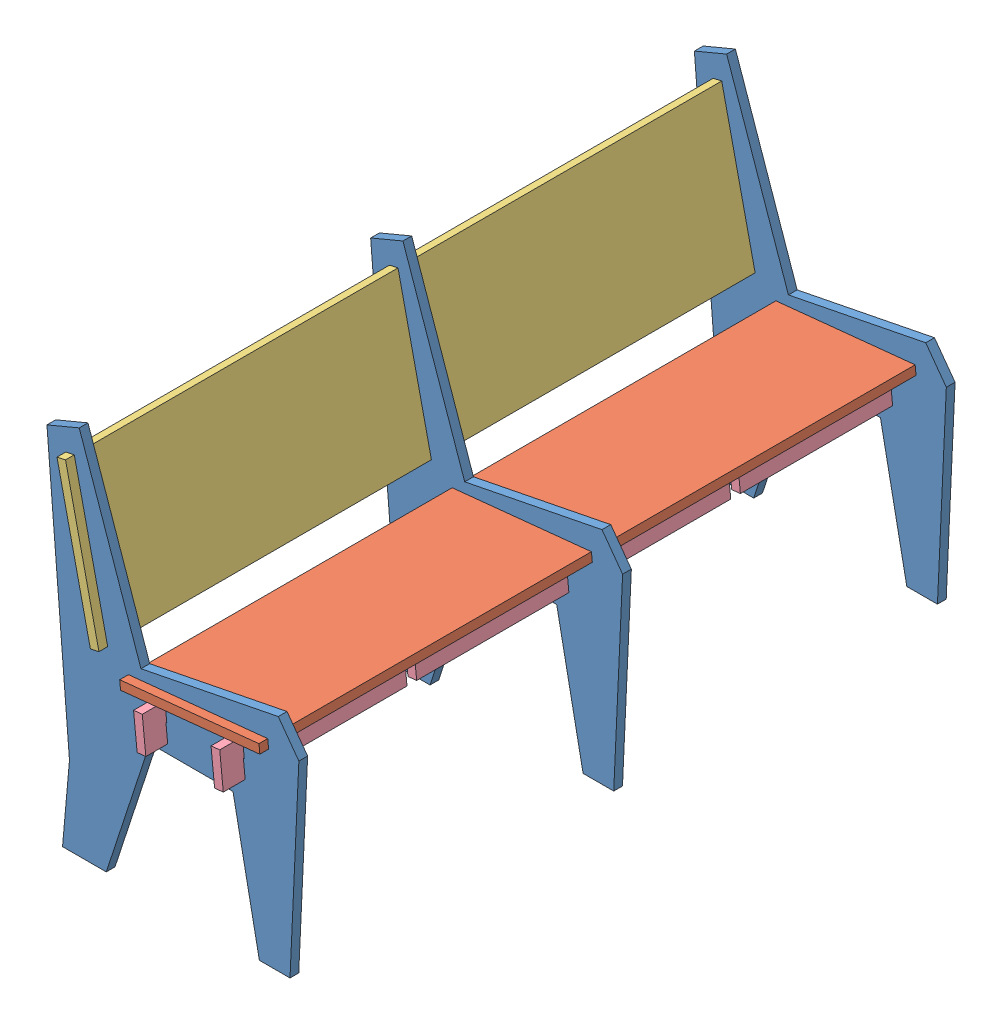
SolidWorks assembly Banc.SLDASM, configuration Défaut (file format 5000). Lengths in mm.
Overall size (575.94 848.12 1600).
7 component instances, 4 part files, 18 mates.
Components (placement in the parent):
- Flanc banc-1: Flanc banc.SLDPRT [Défaut] at origin size (575.94 848.12 20)
- Flanc banc-2: Flanc banc.SLDPRT [Défaut] at (0 0 -740) size (575.94 848.12 20)
- Flanc banc-3: Flanc banc.SLDPRT [Défaut] at (0 0 -1480) size (575.94 848.12 20)
- Assise banc-1: Assise banc.SLDPRT [Défaut] at (310.8644 422.2082 -730) x (0 0 -1) z (0.994811 0.101741 0) size (1540 20 320)
- Dossier banc-1: Dossier banc.SLDPRT [Défaut] at (55.2975 616.2224 -730) x (0 0 -1) z (-0.218199 0.975904 0) size (1540 20 350)
- traverse banc-1: traverse banc.SLDPRT [Défaut] at (231.4829 323.6203 -1529) x (0 0 1) z (-0.994811 -0.101741 0) size (1600 80 20)
- traverse banc-2: traverse banc.SLDPRT [Défaut] at (408.5592 341.7302 -1529) x (0 0 1) z (-0.994811 -0.101741 0) size (1600 80 20)
Mates (geometry in assembly coordinates):
- Coïncidente1: coincident anti-aligned: plane of Flanc banc-1 through (7.3535 784.8236 20) normal (0.975904 0.218199 0); plane of Dossier banc-1 through (45.5384 614.0404 -730) normal (-0.975904 -0.218199 0)
- Coïncidente2: coincident anti-aligned: plane of Flanc banc-1 through (26.8716 789.1876 20) normal (0.218199 -0.975904 0); plane of Dossier banc-1 through (7.3535 784.8236 40) normal (-0.218199 0.975904 0)
- Coïncidente5: coincident aligned: plane of Flanc banc-1 through (15.8848 179.2977 20) normal (-0.996098 0.088249 0); plane of Flanc banc-3 through (15.8848 179.2977 -1460) normal (-0.996098 0.088249 0)
- Coïncidente6: coincident aligned: plane of Flanc banc-1 through (0 0 20) normal (0 -1 0); plane of Flanc banc-3 through (0 0 -1460) normal (0 -1 0)
- Distance2: distance = 1500 mm anti-aligned: plane of Flanc banc-1 through (0 0 20) normal (0 0 1); plane of Flanc banc-3 through (0 0 -1480) normal (0 0 -1)
- Largeur1: width anti-aligned: plane of Dossier banc-1 through (7.3535 784.8236 40) normal (0 0 1); plane of Dossier banc-1 through (7.3535 784.8236 -1500) normal (0 0 -1); plane of Flanc banc-3 through (0 0 -1480) normal (0 0 -1); plane of Flanc banc-1 through (0 0 20) normal (0 0 1)
- Largeur2: width anti-aligned: plane of Assise banc-1 through (469.0167 448.4349 -1500) normal (0 0 -1); plane of Assise banc-1 through (469.0167 448.4349 40) normal (0 0 1); plane of Flanc banc-1 through (0 0 20) normal (0 0 1); plane of Flanc banc-3 through (0 0 -1480) normal (0 0 -1)
- Coïncidente8: coincident anti-aligned: plane of Flanc banc-1 through (150.6772 415.8778 20) normal (0.101741 -0.994811 0); plane of Assise banc-1 through (309.8469 432.1563 -730) normal (-0.101741 0.994811 0)
- Coïncidente9: coincident anti-aligned: plane of Flanc banc-1 through (150.6772 415.8778 20) normal (0.994811 0.101741 0); plane of Assise banc-1 through (150.6772 415.8778 40) normal (-0.994811 -0.101741 0)
- Coïncidente10: coincident anti-aligned: plane of Flanc banc-2 through (152.712 395.9815 -720) normal (-0.101741 0.994811 0); plane of Assise banc-1 through (311.8818 412.2601 -730) normal (0.101741 -0.994811 0)
- Coïncidente11: coincident anti-aligned: plane of Flanc banc-2 through (469.0167 448.4349 -720) normal (-0.994811 -0.101741 0); plane of Assise banc-1 through (469.0167 448.4349 40) normal (0.994811 0.101741 0)
- Largeur3: width anti-aligned: plane of Flanc banc-2 through (0 0 -720) normal (0 0 1); plane of Flanc banc-2 through (0 0 -740) normal (0 0 -1); plane of Flanc banc-1 through (0 0 0) normal (0 0 -1); plane of Flanc banc-3 through (0 0 -1460) normal (0 0 1)
- Coïncidente14: coincident anti-aligned: plane of Flanc banc-1 through (216.4703 362.2936 -0.001) normal (-0.101741 0.994811 0); plane of traverse banc-1 through (217.4641 362.3952 -1) normal (0.101741 -0.994811 0)
- Largeur4: width anti-aligned: plane of traverse banc-1 through (241.431 324.6377 -1529) normal (0.994811 0.101741 0); plane of traverse banc-1 through (221.5348 322.6029 -1529) normal (-0.994811 -0.101741 0); plane of Flanc banc-1 through (234.2865 404.3243 -0.001) normal (-0.994811 -0.101741 0); plane of Flanc banc-1 through (212.4007 402.086 -0.001) normal (0.994811 0.101741 0)
- Largeur5: width anti-aligned: plane of traverse banc-1 through (221.5338 322.6028 -1) normal (0 0 1); plane of traverse banc-1 through (221.5338 322.6028 21) normal (0 0 -1); plane of Flanc banc-1 through (0 0 0) normal (0 0 -1); plane of Flanc banc-1 through (0 0 20) normal (0 0 1)
- Largeur6: width anti-aligned: plane of traverse banc-2 through (418.5073 342.7476 -1529) normal (0.994811 0.101741 0); plane of traverse banc-2 through (398.6111 340.7128 -1529) normal (-0.994811 -0.101741 0); plane of Flanc banc-1 through (411.3629 422.4342 -0.001) normal (-0.994811 -0.101741 0); plane of Flanc banc-1 through (389.477 420.1959 -0.001) normal (0.994811 0.101741 0)
- Largeur7: width aligned: plane of traverse banc-2 through (398.6101 340.7127 -1) normal (0 0 1); plane of traverse banc-2 through (398.6101 340.7127 21) normal (0 0 -1); plane of Flanc banc-1 through (0 0 0) normal (0 0 -1); plane of Flanc banc-1 through (0 0 20) normal (0 0 1)
- Coïncidente16: coincident anti-aligned: plane of Flanc banc-1 through (393.5467 380.4035 -0.001) normal (-0.101741 0.994811 0); plane of traverse banc-2 through (394.5405 380.5051 -1) normal (0.101741 -0.994811 0)
